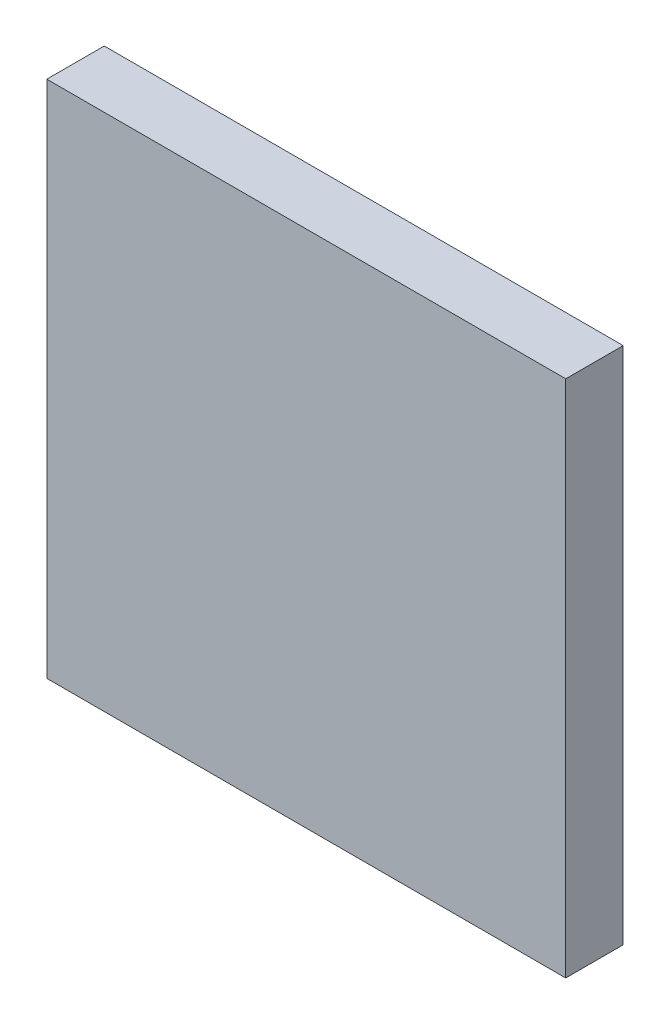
ISO-10303-21;
HEADER;
FILE_DESCRIPTION(('STEP AP214'),'2;1');
FILE_NAME('part.step','',(''),(''),'','','');
FILE_SCHEMA(('AUTOMOTIVE_DESIGN { 1 0 10303 214 1 1 1 1 }'));
ENDSEC;
DATA;
#1=APPLICATION_CONTEXT('core data for automotive mechanical design processes');
#2=APPLICATION_PROTOCOL_DEFINITION('international standard','automotive_design',2000,#1);
#3=PRODUCT_CONTEXT('',#1,'mechanical');
#4=PRODUCT('Part','Part','',(#3));
#5=PRODUCT_RELATED_PRODUCT_CATEGORY('part','',(#4));
#6=PRODUCT_DEFINITION_FORMATION('','',#4);
#7=PRODUCT_DEFINITION_CONTEXT('part definition',#1,'design');
#8=PRODUCT_DEFINITION('design','',#6,#7);
#9=PRODUCT_DEFINITION_SHAPE('','',#8);
#10=(LENGTH_UNIT() NAMED_UNIT(*) SI_UNIT(.MILLI.,.METRE.));
#11=(NAMED_UNIT(*) PLANE_ANGLE_UNIT() SI_UNIT($,.RADIAN.));
#12=(NAMED_UNIT(*) SI_UNIT($,.STERADIAN.) SOLID_ANGLE_UNIT());
#13=UNCERTAINTY_MEASURE_WITH_UNIT(LENGTH_MEASURE(1.E-05),#10,'distance_accuracy_value','');
#14=(GEOMETRIC_REPRESENTATION_CONTEXT(3) GLOBAL_UNCERTAINTY_ASSIGNED_CONTEXT((#13)) GLOBAL_UNIT_ASSIGNED_CONTEXT((#10,
#11,#12)) REPRESENTATION_CONTEXT('',''));
#15=CARTESIAN_POINT('',(0.,0.,0.));
#16=DIRECTION('',(0.,0.,1.));
#17=DIRECTION('',(1.,0.,0.));
#18=AXIS2_PLACEMENT_3D('',#15,#16,#17);
#19=CARTESIAN_POINT('',(-7.00000124,-7.00000124,1.54999944));
#20=DIRECTION('',(0.,0.,-1.));
#21=DIRECTION('',(-1.,0.,0.));
#22=AXIS2_PLACEMENT_3D('',#19,#20,#21);
#23=PLANE('',#22);
#24=DIRECTION('',(1.81428539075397E-07,-0.999999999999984,0.));
#25=VECTOR('',#24,1.);
#26=CARTESIAN_POINT('',(7.00000378,-7.00000124,1.54999944));
#27=LINE('',#26,#25);
#28=CARTESIAN_POINT('',(7.00000251,-7.00000124,1.54999944));
#29=VERTEX_POINT('',#28);
#30=CARTESIAN_POINT('',(7.00000124,7.00000124,1.54999944));
#31=VERTEX_POINT('',#30);
#32=EDGE_CURVE('E54',#29,#31,#27,.F.);
#33=ORIENTED_EDGE('',*,*,#32,.T.);
#34=DIRECTION('',(1.,0.,0.));
#35=VECTOR('',#34,1.);
#36=CARTESIAN_POINT('',(7.00000124,7.00000124,1.54999944));
#37=LINE('',#36,#35);
#38=CARTESIAN_POINT('',(-7.00000124,7.00000124,1.54999944));
#39=VERTEX_POINT('',#38);
#40=EDGE_CURVE('E56',#31,#39,#37,.F.);
#41=ORIENTED_EDGE('',*,*,#40,.T.);
#42=DIRECTION('',(0.,1.,0.));
#43=VECTOR('',#42,1.);
#44=CARTESIAN_POINT('',(-7.00000124,7.00000124,1.54999944));
#45=LINE('',#44,#43);
#46=CARTESIAN_POINT('',(-7.00000124,-7.00000124,1.54999944));
#47=VERTEX_POINT('',#46);
#48=EDGE_CURVE('E19',#39,#47,#45,.F.);
#49=ORIENTED_EDGE('',*,*,#48,.T.);
#50=DIRECTION('',(1.,0.,0.));
#51=VECTOR('',#50,1.);
#52=CARTESIAN_POINT('',(-7.00000124,-7.00000124,1.54999944));
#53=LINE('',#52,#51);
#54=EDGE_CURVE('E79',#47,#29,#53,.T.);
#55=ORIENTED_EDGE('',*,*,#54,.T.);
#56=EDGE_LOOP('',(#33,#41,#49,#55));
#57=FACE_BOUND('',#56,.T.);
#58=ADVANCED_FACE('F16',(#57),#23,.F.);
#59=CARTESIAN_POINT('',(-7.00000124,7.00000124,0.));
#60=DIRECTION('',(1.,0.,0.));
#61=DIRECTION('',(0.,0.,-1.));
#62=AXIS2_PLACEMENT_3D('',#59,#60,#61);
#63=PLANE('',#62);
#64=DIRECTION('',(0.,0.,1.));
#65=VECTOR('',#64,1.);
#66=CARTESIAN_POINT('',(-7.00000124,-7.00000124,0.));
#67=LINE('',#66,#65);
#68=CARTESIAN_POINT('',(-7.00000124,-7.00000124,0.));
#69=VERTEX_POINT('',#68);
#70=EDGE_CURVE('E67',#69,#47,#67,.T.);
#71=ORIENTED_EDGE('',*,*,#70,.T.);
#72=ORIENTED_EDGE('',*,*,#48,.F.);
#73=DIRECTION('',(0.,0.,-1.));
#74=VECTOR('',#73,1.);
#75=CARTESIAN_POINT('',(-7.00000124,7.00000124,0.));
#76=LINE('',#75,#74);
#77=CARTESIAN_POINT('',(-7.00000124,7.00000124,0.));
#78=VERTEX_POINT('',#77);
#79=EDGE_CURVE('E62',#39,#78,#76,.T.);
#80=ORIENTED_EDGE('',*,*,#79,.T.);
#81=DIRECTION('',(0.,1.,0.));
#82=VECTOR('',#81,1.);
#83=CARTESIAN_POINT('',(-7.00000124,-7.00000124,0.));
#84=LINE('',#83,#82);
#85=EDGE_CURVE('E82',#69,#78,#84,.T.);
#86=ORIENTED_EDGE('',*,*,#85,.F.);
#87=EDGE_LOOP('',(#71,#72,#80,#86));
#88=FACE_BOUND('',#87,.T.);
#89=ADVANCED_FACE('F64',(#88),#63,.F.);
#90=CARTESIAN_POINT('',(7.00000124,7.00000124,0.));
#91=DIRECTION('',(0.,-1.,0.));
#92=DIRECTION('',(0.,0.,-1.));
#93=AXIS2_PLACEMENT_3D('',#90,#91,#92);
#94=PLANE('',#93);
#95=ORIENTED_EDGE('',*,*,#79,.F.);
#96=ORIENTED_EDGE('',*,*,#40,.F.);
#97=DIRECTION('',(0.,0.,1.));
#98=VECTOR('',#97,1.);
#99=CARTESIAN_POINT('',(7.00000124,7.00000124,0.));
#100=LINE('',#99,#98);
#101=CARTESIAN_POINT('',(7.00000124,7.00000124,0.));
#102=VERTEX_POINT('',#101);
#103=EDGE_CURVE('E74',#31,#102,#100,.F.);
#104=ORIENTED_EDGE('',*,*,#103,.T.);
#105=DIRECTION('',(-1.,0.,0.));
#106=VECTOR('',#105,1.);
#107=CARTESIAN_POINT('',(-7.00000124,7.00000124,0.));
#108=LINE('',#107,#106);
#109=EDGE_CURVE('E71',#78,#102,#108,.F.);
#110=ORIENTED_EDGE('',*,*,#109,.F.);
#111=EDGE_LOOP('',(#95,#96,#104,#110));
#112=FACE_BOUND('',#111,.T.);
#113=ADVANCED_FACE('F69',(#112),#94,.F.);
#114=CARTESIAN_POINT('',(7.00000378,-7.00000124,0.));
#115=DIRECTION('',(-0.999999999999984,-1.81428539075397E-07,0.));
#116=DIRECTION('',(1.81428539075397E-07,-0.999999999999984,0.));
#117=AXIS2_PLACEMENT_3D('',#114,#115,#116);
#118=PLANE('',#117);
#119=ORIENTED_EDGE('',*,*,#103,.F.);
#120=ORIENTED_EDGE('',*,*,#32,.F.);
#121=DIRECTION('',(0.,0.,1.));
#122=VECTOR('',#121,1.);
#123=CARTESIAN_POINT('',(7.00000378,-7.00000124,0.));
#124=LINE('',#123,#122);
#125=CARTESIAN_POINT('',(7.000003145,-7.00000124,0.));
#126=VERTEX_POINT('',#125);
#127=EDGE_CURVE('E34',#29,#126,#124,.F.);
#128=ORIENTED_EDGE('',*,*,#127,.T.);
#129=DIRECTION('',(0.,1.,0.));
#130=VECTOR('',#129,1.);
#131=CARTESIAN_POINT('',(7.00000124,-7.00000124,0.));
#132=LINE('',#131,#130);
#133=EDGE_CURVE('E25',#102,#126,#132,.F.);
#134=ORIENTED_EDGE('',*,*,#133,.F.);
#135=EDGE_LOOP('',(#119,#120,#128,#134));
#136=FACE_BOUND('',#135,.T.);
#137=ADVANCED_FACE('F88',(#136),#118,.F.);
#138=CARTESIAN_POINT('',(-7.00000124,-7.00000124,0.));
#139=DIRECTION('',(0.,1.,0.));
#140=DIRECTION('',(0.,0.,1.));
#141=AXIS2_PLACEMENT_3D('',#138,#139,#140);
#142=PLANE('',#141);
#143=ORIENTED_EDGE('',*,*,#127,.F.);
#144=ORIENTED_EDGE('',*,*,#54,.F.);
#145=ORIENTED_EDGE('',*,*,#70,.F.);
#146=DIRECTION('',(-1.,0.,0.));
#147=VECTOR('',#146,1.);
#148=CARTESIAN_POINT('',(-7.00000124,-7.00000124,0.));
#149=LINE('',#148,#147);
#150=EDGE_CURVE('E10',#126,#69,#149,.T.);
#151=ORIENTED_EDGE('',*,*,#150,.F.);
#152=EDGE_LOOP('',(#143,#144,#145,#151));
#153=FACE_BOUND('',#152,.T.);
#154=ADVANCED_FACE('F90',(#153),#142,.F.);
#155=CARTESIAN_POINT('',(-7.00000124,-7.00000124,0.));
#156=DIRECTION('',(0.,0.,-1.));
#157=DIRECTION('',(-1.,0.,0.));
#158=AXIS2_PLACEMENT_3D('',#155,#156,#157);
#159=PLANE('',#158);
#160=ORIENTED_EDGE('',*,*,#133,.T.);
#161=ORIENTED_EDGE('',*,*,#150,.T.);
#162=ORIENTED_EDGE('',*,*,#85,.T.);
#163=ORIENTED_EDGE('',*,*,#109,.T.);
#164=EDGE_LOOP('',(#160,#161,#162,#163));
#165=FACE_BOUND('',#164,.T.);
#166=ADVANCED_FACE('F87',(#165),#159,.T.);
#167=CLOSED_SHELL('',(#58,#89,#113,#137,#154,#166));
#168=MANIFOLD_SOLID_BREP('B1',#167);
#169=ADVANCED_BREP_SHAPE_REPRESENTATION('',(#18,#168),#14);
#170=SHAPE_DEFINITION_REPRESENTATION(#9,#169);
ENDSEC;
END-ISO-10303-21;
